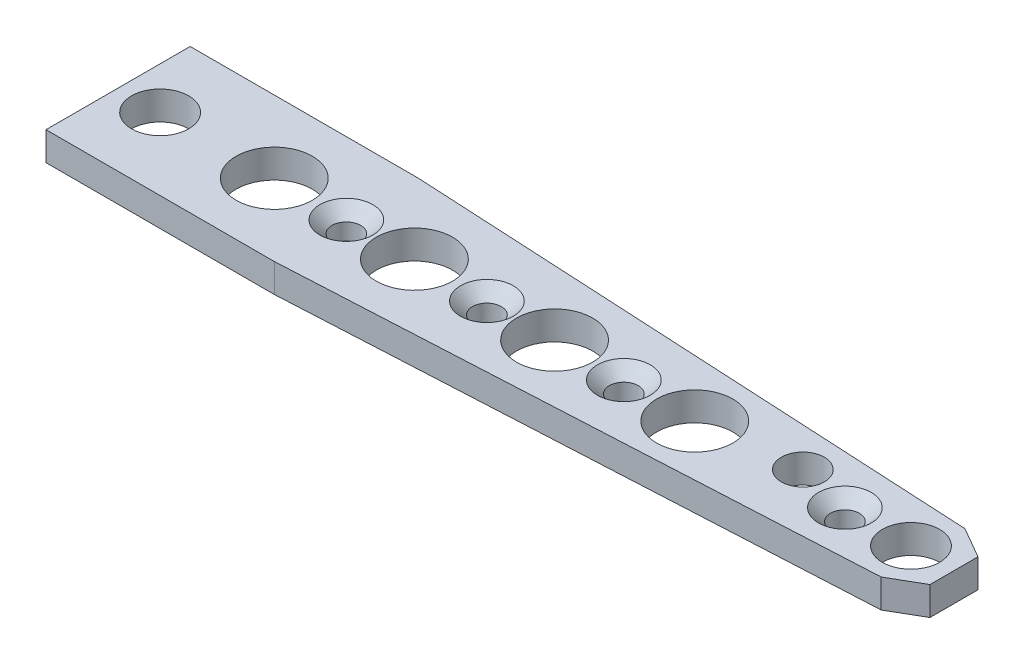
ISO-10303-21;
HEADER;
FILE_DESCRIPTION(('STEP AP214'),'2;1');
FILE_NAME('part.step','',(''),(''),'','','');
FILE_SCHEMA(('AUTOMOTIVE_DESIGN { 1 0 10303 214 1 1 1 1 }'));
ENDSEC;
DATA;
#1=APPLICATION_CONTEXT('core data for automotive mechanical design processes');
#2=APPLICATION_PROTOCOL_DEFINITION('international standard','automotive_design',2000,#1);
#3=PRODUCT_CONTEXT('',#1,'mechanical');
#4=PRODUCT('Part','Part','',(#3));
#5=PRODUCT_RELATED_PRODUCT_CATEGORY('part','',(#4));
#6=PRODUCT_DEFINITION_FORMATION('','',#4);
#7=PRODUCT_DEFINITION_CONTEXT('part definition',#1,'design');
#8=PRODUCT_DEFINITION('design','',#6,#7);
#9=PRODUCT_DEFINITION_SHAPE('','',#8);
#10=(LENGTH_UNIT() NAMED_UNIT(*) SI_UNIT(.MILLI.,.METRE.));
#11=(NAMED_UNIT(*) PLANE_ANGLE_UNIT() SI_UNIT($,.RADIAN.));
#12=(NAMED_UNIT(*) SI_UNIT($,.STERADIAN.) SOLID_ANGLE_UNIT());
#13=UNCERTAINTY_MEASURE_WITH_UNIT(LENGTH_MEASURE(1.E-05),#10,'distance_accuracy_value','');
#14=(GEOMETRIC_REPRESENTATION_CONTEXT(3) GLOBAL_UNCERTAINTY_ASSIGNED_CONTEXT((#13)) GLOBAL_UNIT_ASSIGNED_CONTEXT((#10,
#11,#12)) REPRESENTATION_CONTEXT('',''));
#15=CARTESIAN_POINT('',(0.,0.,0.));
#16=DIRECTION('',(0.,0.,1.));
#17=DIRECTION('',(1.,0.,0.));
#18=AXIS2_PLACEMENT_3D('',#15,#16,#17);
#19=CARTESIAN_POINT('',(69.58,2.38,-3.35));
#20=DIRECTION('',(-1.,0.,0.));
#21=DIRECTION('',(0.,0.,1.));
#22=AXIS2_PLACEMENT_3D('',#19,#20,#21);
#23=PLANE('',#22);
#24=DIRECTION('',(0.,0.,-1.));
#25=VECTOR('',#24,1.);
#26=CARTESIAN_POINT('',(69.58,2.38,-3.35));
#27=LINE('',#26,#25);
#28=CARTESIAN_POINT('',(69.58,2.38,2.00000000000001));
#29=VERTEX_POINT('',#28);
#30=CARTESIAN_POINT('',(69.58,2.38,-2.00000000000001));
#31=VERTEX_POINT('',#30);
#32=EDGE_CURVE('E116',#29,#31,#27,.T.);
#33=ORIENTED_EDGE('',*,*,#32,.F.);
#34=DIRECTION('',(0.,-1.,0.));
#35=VECTOR('',#34,1.);
#36=CARTESIAN_POINT('',(69.58,2.38,2.00000000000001));
#37=LINE('',#36,#35);
#38=CARTESIAN_POINT('',(69.58,0.,2.00000000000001));
#39=VERTEX_POINT('',#38);
#40=EDGE_CURVE('E192',#29,#39,#37,.T.);
#41=ORIENTED_EDGE('',*,*,#40,.T.);
#42=DIRECTION('',(0.,0.,-1.));
#43=VECTOR('',#42,1.);
#44=CARTESIAN_POINT('',(69.58,0.,-3.35));
#45=LINE('',#44,#43);
#46=CARTESIAN_POINT('',(69.58,0.,-2.00000000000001));
#47=VERTEX_POINT('',#46);
#48=EDGE_CURVE('E148',#39,#47,#45,.T.);
#49=ORIENTED_EDGE('',*,*,#48,.T.);
#50=DIRECTION('',(0.,1.,0.));
#51=VECTOR('',#50,1.);
#52=CARTESIAN_POINT('',(69.58,2.38,-2.00000000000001));
#53=LINE('',#52,#51);
#54=EDGE_CURVE('E189',#47,#31,#53,.T.);
#55=ORIENTED_EDGE('',*,*,#54,.T.);
#56=EDGE_LOOP('',(#33,#41,#49,#55));
#57=FACE_BOUND('',#56,.T.);
#58=ADVANCED_FACE('F40',(#57),#23,.F.);
#59=CARTESIAN_POINT('',(69.58,2.38,-3.35));
#60=DIRECTION('',(-0.0523359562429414,0.,0.998629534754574));
#61=DIRECTION('',(0.998629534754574,0.,0.0523359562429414));
#62=AXIS2_PLACEMENT_3D('',#59,#60,#61);
#63=PLANE('',#62);
#64=DIRECTION('',(-0.998629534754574,0.,-0.0523359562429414));
#65=VECTOR('',#64,1.);
#66=CARTESIAN_POINT('',(69.58,2.38,-3.35));
#67=LINE('',#66,#65);
#68=CARTESIAN_POINT('',(67.0082897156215,2.38,-3.48477762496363));
#69=VERTEX_POINT('',#68);
#70=CARTESIAN_POINT('',(19.0149877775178,2.38,-6.));
#71=VERTEX_POINT('',#70);
#72=EDGE_CURVE('E106',#69,#71,#67,.T.);
#73=ORIENTED_EDGE('',*,*,#72,.F.);
#74=DIRECTION('',(0.,-1.,0.));
#75=VECTOR('',#74,1.);
#76=CARTESIAN_POINT('',(67.0082897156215,2.38,-3.48477762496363));
#77=LINE('',#76,#75);
#78=CARTESIAN_POINT('',(67.0082897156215,0.,-3.48477762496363));
#79=VERTEX_POINT('',#78);
#80=EDGE_CURVE('E11',#69,#79,#77,.T.);
#81=ORIENTED_EDGE('',*,*,#80,.T.);
#82=DIRECTION('',(-0.998629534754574,0.,-0.0523359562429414));
#83=VECTOR('',#82,1.);
#84=CARTESIAN_POINT('',(69.58,0.,-3.35));
#85=LINE('',#84,#83);
#86=CARTESIAN_POINT('',(19.0149877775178,0.,-6.));
#87=VERTEX_POINT('',#86);
#88=EDGE_CURVE('E122',#79,#87,#85,.T.);
#89=ORIENTED_EDGE('',*,*,#88,.T.);
#90=DIRECTION('',(0.,-1.,0.));
#91=VECTOR('',#90,1.);
#92=CARTESIAN_POINT('',(19.0149877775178,2.38,-6.));
#93=LINE('',#92,#91);
#94=EDGE_CURVE('E119',#71,#87,#93,.T.);
#95=ORIENTED_EDGE('',*,*,#94,.F.);
#96=EDGE_LOOP('',(#73,#81,#89,#95));
#97=FACE_BOUND('',#96,.T.);
#98=ADVANCED_FACE('F120',(#97),#63,.F.);
#99=CARTESIAN_POINT('',(0.,2.38,-6.));
#100=DIRECTION('',(0.,0.,1.));
#101=DIRECTION('',(1.,0.,0.));
#102=AXIS2_PLACEMENT_3D('',#99,#100,#101);
#103=PLANE('',#102);
#104=DIRECTION('',(-1.,0.,0.));
#105=VECTOR('',#104,1.);
#106=CARTESIAN_POINT('',(0.,0.,-6.));
#107=LINE('',#106,#105);
#108=CARTESIAN_POINT('',(0.,0.,-6.));
#109=VERTEX_POINT('',#108);
#110=EDGE_CURVE('E155',#87,#109,#107,.T.);
#111=ORIENTED_EDGE('',*,*,#110,.T.);
#112=DIRECTION('',(0.,-1.,0.));
#113=VECTOR('',#112,1.);
#114=CARTESIAN_POINT('',(0.,2.38,-6.));
#115=LINE('',#114,#113);
#116=CARTESIAN_POINT('',(0.,2.38,-6.));
#117=VERTEX_POINT('',#116);
#118=EDGE_CURVE('E127',#117,#109,#115,.T.);
#119=ORIENTED_EDGE('',*,*,#118,.F.);
#120=DIRECTION('',(-1.,0.,0.));
#121=VECTOR('',#120,1.);
#122=CARTESIAN_POINT('',(0.,2.38,-6.));
#123=LINE('',#122,#121);
#124=EDGE_CURVE('E111',#71,#117,#123,.T.);
#125=ORIENTED_EDGE('',*,*,#124,.F.);
#126=ORIENTED_EDGE('',*,*,#94,.T.);
#127=EDGE_LOOP('',(#111,#119,#125,#126));
#128=FACE_BOUND('',#127,.T.);
#129=ADVANCED_FACE('F129',(#128),#103,.F.);
#130=CARTESIAN_POINT('',(0.,2.38,-6.));
#131=DIRECTION('',(1.,0.,0.));
#132=DIRECTION('',(0.,0.,-1.));
#133=AXIS2_PLACEMENT_3D('',#130,#131,#132);
#134=PLANE('',#133);
#135=DIRECTION('',(0.,0.,1.));
#136=VECTOR('',#135,1.);
#137=CARTESIAN_POINT('',(0.,0.,-6.));
#138=LINE('',#137,#136);
#139=CARTESIAN_POINT('',(0.,0.,6.));
#140=VERTEX_POINT('',#139);
#141=EDGE_CURVE('E158',#109,#140,#138,.T.);
#142=ORIENTED_EDGE('',*,*,#141,.T.);
#143=DIRECTION('',(0.,-1.,0.));
#144=VECTOR('',#143,1.);
#145=CARTESIAN_POINT('',(0.,2.38,6.));
#146=LINE('',#145,#144);
#147=CARTESIAN_POINT('',(0.,2.38,6.));
#148=VERTEX_POINT('',#147);
#149=EDGE_CURVE('E169',#148,#140,#146,.T.);
#150=ORIENTED_EDGE('',*,*,#149,.F.);
#151=DIRECTION('',(0.,0.,1.));
#152=VECTOR('',#151,1.);
#153=CARTESIAN_POINT('',(0.,2.38,-6.));
#154=LINE('',#153,#152);
#155=EDGE_CURVE('E133',#117,#148,#154,.T.);
#156=ORIENTED_EDGE('',*,*,#155,.F.);
#157=ORIENTED_EDGE('',*,*,#118,.T.);
#158=EDGE_LOOP('',(#142,#150,#156,#157));
#159=FACE_BOUND('',#158,.T.);
#160=ADVANCED_FACE('F229',(#159),#134,.F.);
#161=CARTESIAN_POINT('',(0.,2.38,6.));
#162=DIRECTION('',(0.,0.,-1.));
#163=DIRECTION('',(-1.,0.,0.));
#164=AXIS2_PLACEMENT_3D('',#161,#162,#163);
#165=PLANE('',#164);
#166=DIRECTION('',(1.,0.,0.));
#167=VECTOR('',#166,1.);
#168=CARTESIAN_POINT('',(0.,0.,6.));
#169=LINE('',#168,#167);
#170=CARTESIAN_POINT('',(19.0149877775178,0.,5.99999999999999));
#171=VERTEX_POINT('',#170);
#172=EDGE_CURVE('E160',#140,#171,#169,.T.);
#173=ORIENTED_EDGE('',*,*,#172,.T.);
#174=DIRECTION('',(0.,-1.,0.));
#175=VECTOR('',#174,1.);
#176=CARTESIAN_POINT('',(19.0149877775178,2.38,5.99999999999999));
#177=LINE('',#176,#175);
#178=CARTESIAN_POINT('',(19.0149877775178,2.38,5.99999999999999));
#179=VERTEX_POINT('',#178);
#180=EDGE_CURVE('E147',#179,#171,#177,.T.);
#181=ORIENTED_EDGE('',*,*,#180,.F.);
#182=DIRECTION('',(1.,0.,0.));
#183=VECTOR('',#182,1.);
#184=CARTESIAN_POINT('',(0.,2.38,6.));
#185=LINE('',#184,#183);
#186=EDGE_CURVE('E138',#148,#179,#185,.T.);
#187=ORIENTED_EDGE('',*,*,#186,.F.);
#188=ORIENTED_EDGE('',*,*,#149,.T.);
#189=EDGE_LOOP('',(#173,#181,#187,#188));
#190=FACE_BOUND('',#189,.T.);
#191=ADVANCED_FACE('F225',(#190),#165,.F.);
#192=CARTESIAN_POINT('',(19.0149877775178,2.38,5.99999999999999));
#193=DIRECTION('',(-0.0523359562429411,0.,-0.998629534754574));
#194=DIRECTION('',(-0.998629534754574,0.,0.0523359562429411));
#195=AXIS2_PLACEMENT_3D('',#192,#193,#194);
#196=PLANE('',#195);
#197=DIRECTION('',(0.998629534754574,0.,-0.0523359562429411));
#198=VECTOR('',#197,1.);
#199=CARTESIAN_POINT('',(19.0149877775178,0.,5.99999999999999));
#200=LINE('',#199,#198);
#201=CARTESIAN_POINT('',(67.0082897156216,0.,3.48477762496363));
#202=VERTEX_POINT('',#201);
#203=EDGE_CURVE('E163',#171,#202,#200,.T.);
#204=ORIENTED_EDGE('',*,*,#203,.T.);
#205=DIRECTION('',(0.,1.,0.));
#206=VECTOR('',#205,1.);
#207=CARTESIAN_POINT('',(67.0082897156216,2.38,3.48477762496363));
#208=LINE('',#207,#206);
#209=CARTESIAN_POINT('',(67.0082897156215,2.38,3.48477762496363));
#210=VERTEX_POINT('',#209);
#211=EDGE_CURVE('E64',#202,#210,#208,.T.);
#212=ORIENTED_EDGE('',*,*,#211,.T.);
#213=DIRECTION('',(0.998629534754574,0.,-0.0523359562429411));
#214=VECTOR('',#213,1.);
#215=CARTESIAN_POINT('',(19.0149877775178,2.38,5.99999999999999));
#216=LINE('',#215,#214);
#217=EDGE_CURVE('E144',#179,#210,#216,.T.);
#218=ORIENTED_EDGE('',*,*,#217,.F.);
#219=ORIENTED_EDGE('',*,*,#180,.T.);
#220=EDGE_LOOP('',(#204,#212,#218,#219));
#221=FACE_BOUND('',#220,.T.);
#222=ADVANCED_FACE('F221',(#221),#196,.F.);
#223=CARTESIAN_POINT('',(0.,2.38,0.));
#224=DIRECTION('',(0.,1.,0.));
#225=DIRECTION('',(0.,0.,1.));
#226=AXIS2_PLACEMENT_3D('',#223,#224,#225);
#227=PLANE('',#226);
#228=CARTESIAN_POINT('',(3.5,2.38,0.));
#229=DIRECTION('',(0.,1.,0.));
#230=DIRECTION('',(0.,0.,1.));
#231=AXIS2_PLACEMENT_3D('',#228,#229,#230);
#232=CIRCLE('',#231,2.38124999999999);
#233=CARTESIAN_POINT('',(3.5,2.38,2.38124999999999));
#234=VERTEX_POINT('',#233);
#235=EDGE_CURVE('E513',#234,#234,#232,.T.);
#236=ORIENTED_EDGE('',*,*,#235,.F.);
#237=EDGE_LOOP('',(#236));
#238=FACE_BOUND('',#237,.T.);
#239=CARTESIAN_POINT('',(66.,2.38,0.));
#240=DIRECTION('',(0.,1.,0.));
#241=DIRECTION('',(0.,0.,1.));
#242=AXIS2_PLACEMENT_3D('',#239,#240,#241);
#243=CIRCLE('',#242,2.38124999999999);
#244=CARTESIAN_POINT('',(66.,2.38,2.38124999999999));
#245=VERTEX_POINT('',#244);
#246=EDGE_CURVE('E518',#245,#245,#243,.T.);
#247=ORIENTED_EDGE('',*,*,#246,.F.);
#248=EDGE_LOOP('',(#247));
#249=FACE_BOUND('',#248,.T.);
#250=CARTESIAN_POINT('',(19.,2.38,0.));
#251=DIRECTION('',(0.,1.,0.));
#252=DIRECTION('',(0.,0.,1.));
#253=AXIS2_PLACEMENT_3D('',#250,#251,#252);
#254=CIRCLE('',#253,2.2);
#255=CARTESIAN_POINT('',(19.,2.38,2.2));
#256=VERTEX_POINT('',#255);
#257=EDGE_CURVE('E527',#256,#256,#254,.T.);
#258=ORIENTED_EDGE('',*,*,#257,.F.);
#259=EDGE_LOOP('',(#258));
#260=FACE_BOUND('',#259,.T.);
#261=CARTESIAN_POINT('',(30.7,2.38,0.));
#262=DIRECTION('',(0.,1.,0.));
#263=DIRECTION('',(0.,0.,1.));
#264=AXIS2_PLACEMENT_3D('',#261,#262,#263);
#265=CIRCLE('',#264,2.2);
#266=CARTESIAN_POINT('',(30.7,2.38,2.2));
#267=VERTEX_POINT('',#266);
#268=EDGE_CURVE('E539',#267,#267,#265,.T.);
#269=ORIENTED_EDGE('',*,*,#268,.F.);
#270=EDGE_LOOP('',(#269));
#271=FACE_BOUND('',#270,.T.);
#272=CARTESIAN_POINT('',(42.1,2.38,0.));
#273=DIRECTION('',(0.,1.,0.));
#274=DIRECTION('',(0.,0.,1.));
#275=AXIS2_PLACEMENT_3D('',#272,#273,#274);
#276=CIRCLE('',#275,2.2);
#277=CARTESIAN_POINT('',(42.1,2.38,2.2));
#278=VERTEX_POINT('',#277);
#279=EDGE_CURVE('E551',#278,#278,#276,.T.);
#280=ORIENTED_EDGE('',*,*,#279,.F.);
#281=EDGE_LOOP('',(#280));
#282=FACE_BOUND('',#281,.T.);
#283=CARTESIAN_POINT('',(60.5,2.38,0.));
#284=DIRECTION('',(0.,1.,0.));
#285=DIRECTION('',(0.,0.,1.));
#286=AXIS2_PLACEMENT_3D('',#283,#284,#285);
#287=CIRCLE('',#286,2.19999999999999);
#288=CARTESIAN_POINT('',(60.5,2.38,2.19999999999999));
#289=VERTEX_POINT('',#288);
#290=EDGE_CURVE('E563',#289,#289,#287,.T.);
#291=ORIENTED_EDGE('',*,*,#290,.F.);
#292=EDGE_LOOP('',(#291));
#293=FACE_BOUND('',#292,.T.);
#294=CARTESIAN_POINT('',(56.,2.38,-1.));
#295=DIRECTION('',(0.,1.,0.));
#296=DIRECTION('',(0.,0.,1.));
#297=AXIS2_PLACEMENT_3D('',#294,#295,#296);
#298=CIRCLE('',#297,1.78600099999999);
#299=CARTESIAN_POINT('',(56.,2.38,0.786000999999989));
#300=VERTEX_POINT('',#299);
#301=EDGE_CURVE('E575',#300,#300,#298,.T.);
#302=ORIENTED_EDGE('',*,*,#301,.F.);
#303=EDGE_LOOP('',(#302));
#304=FACE_BOUND('',#303,.T.);
#305=CARTESIAN_POINT('',(24.667,2.38,0.));
#306=DIRECTION('',(0.,1.,0.));
#307=DIRECTION('',(0.,0.,1.));
#308=AXIS2_PLACEMENT_3D('',#305,#306,#307);
#309=CIRCLE('',#308,3.175);
#310=CARTESIAN_POINT('',(24.667,2.38,3.175));
#311=VERTEX_POINT('',#310);
#312=EDGE_CURVE('E587',#311,#311,#309,.T.);
#313=ORIENTED_EDGE('',*,*,#312,.F.);
#314=EDGE_LOOP('',(#313));
#315=FACE_BOUND('',#314,.T.);
#316=CARTESIAN_POINT('',(13.,2.38,0.));
#317=DIRECTION('',(0.,1.,0.));
#318=DIRECTION('',(0.,0.,1.));
#319=AXIS2_PLACEMENT_3D('',#316,#317,#318);
#320=CIRCLE('',#319,3.175);
#321=CARTESIAN_POINT('',(13.,2.38,3.175));
#322=VERTEX_POINT('',#321);
#323=EDGE_CURVE('E591',#322,#322,#320,.T.);
#324=ORIENTED_EDGE('',*,*,#323,.F.);
#325=EDGE_LOOP('',(#324));
#326=FACE_BOUND('',#325,.T.);
#327=ORIENTED_EDGE('',*,*,#217,.T.);
#328=DIRECTION('',(-0.86602540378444,0.,0.499999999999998));
#329=VECTOR('',#328,1.);
#330=CARTESIAN_POINT('',(18.2610254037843,2.38,31.6290237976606));
#331=LINE('',#330,#329);
#332=EDGE_CURVE('E49',#210,#29,#331,.F.);
#333=ORIENTED_EDGE('',*,*,#332,.T.);
#334=ORIENTED_EDGE('',*,*,#32,.T.);
#335=DIRECTION('',(0.86602540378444,0.,0.499999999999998));
#336=VECTOR('',#335,1.);
#337=CARTESIAN_POINT('',(18.2610254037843,2.38,-31.6290237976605));
#338=LINE('',#337,#336);
#339=EDGE_CURVE('E56',#31,#69,#338,.F.);
#340=ORIENTED_EDGE('',*,*,#339,.T.);
#341=ORIENTED_EDGE('',*,*,#72,.T.);
#342=ORIENTED_EDGE('',*,*,#124,.T.);
#343=ORIENTED_EDGE('',*,*,#155,.T.);
#344=ORIENTED_EDGE('',*,*,#186,.T.);
#345=EDGE_LOOP('',(#327,#333,#334,#340,#341,#342,#343,#344));
#346=FACE_BOUND('',#345,.T.);
#347=CARTESIAN_POINT('',(36.334,2.38,0.));
#348=DIRECTION('',(0.,1.,0.));
#349=DIRECTION('',(0.,0.,1.));
#350=AXIS2_PLACEMENT_3D('',#347,#348,#349);
#351=CIRCLE('',#350,3.175);
#352=CARTESIAN_POINT('',(36.334,2.38,3.175));
#353=VERTEX_POINT('',#352);
#354=EDGE_CURVE('E177',#353,#353,#351,.T.);
#355=ORIENTED_EDGE('',*,*,#354,.F.);
#356=EDGE_LOOP('',(#355));
#357=FACE_BOUND('',#356,.T.);
#358=CARTESIAN_POINT('',(48.001,2.38,0.));
#359=DIRECTION('',(0.,1.,0.));
#360=DIRECTION('',(0.,0.,1.));
#361=AXIS2_PLACEMENT_3D('',#358,#359,#360);
#362=CIRCLE('',#361,3.175);
#363=CARTESIAN_POINT('',(48.001,2.38,3.175));
#364=VERTEX_POINT('',#363);
#365=EDGE_CURVE('E185',#364,#364,#362,.T.);
#366=ORIENTED_EDGE('',*,*,#365,.F.);
#367=EDGE_LOOP('',(#366));
#368=FACE_BOUND('',#367,.T.);
#369=ADVANCED_FACE('F108',(#238,#249,#260,#271,#282,#293,#304,#315,#326,#346,#357,#368),#227,.T.);
#370=CARTESIAN_POINT('',(0.,0.,0.));
#371=DIRECTION('',(0.,1.,0.));
#372=DIRECTION('',(0.,0.,1.));
#373=AXIS2_PLACEMENT_3D('',#370,#371,#372);
#374=PLANE('',#373);
#375=CARTESIAN_POINT('',(3.5,0.,0.));
#376=DIRECTION('',(0.,1.,0.));
#377=DIRECTION('',(0.,0.,1.));
#378=AXIS2_PLACEMENT_3D('',#375,#376,#377);
#379=CIRCLE('',#378,2.38125);
#380=CARTESIAN_POINT('',(3.5,0.,2.38125));
#381=VERTEX_POINT('',#380);
#382=EDGE_CURVE('E510',#381,#381,#379,.T.);
#383=ORIENTED_EDGE('',*,*,#382,.T.);
#384=EDGE_LOOP('',(#383));
#385=FACE_BOUND('',#384,.T.);
#386=CARTESIAN_POINT('',(66.,0.,0.));
#387=DIRECTION('',(0.,1.,0.));
#388=DIRECTION('',(0.,0.,1.));
#389=AXIS2_PLACEMENT_3D('',#386,#387,#388);
#390=CIRCLE('',#389,2.38125);
#391=CARTESIAN_POINT('',(66.,0.,2.38125));
#392=VERTEX_POINT('',#391);
#393=EDGE_CURVE('E523',#392,#392,#390,.T.);
#394=ORIENTED_EDGE('',*,*,#393,.T.);
#395=EDGE_LOOP('',(#394));
#396=FACE_BOUND('',#395,.T.);
#397=CARTESIAN_POINT('',(19.,0.,0.));
#398=DIRECTION('',(0.,1.,0.));
#399=DIRECTION('',(0.,0.,1.));
#400=AXIS2_PLACEMENT_3D('',#397,#398,#399);
#401=CIRCLE('',#400,1.2);
#402=CARTESIAN_POINT('',(19.,0.,1.2));
#403=VERTEX_POINT('',#402);
#404=EDGE_CURVE('E535',#403,#403,#401,.T.);
#405=ORIENTED_EDGE('',*,*,#404,.T.);
#406=EDGE_LOOP('',(#405));
#407=FACE_BOUND('',#406,.T.);
#408=CARTESIAN_POINT('',(30.7,0.,0.));
#409=DIRECTION('',(0.,1.,0.));
#410=DIRECTION('',(0.,0.,1.));
#411=AXIS2_PLACEMENT_3D('',#408,#409,#410);
#412=CIRCLE('',#411,1.2);
#413=CARTESIAN_POINT('',(30.7,0.,1.2));
#414=VERTEX_POINT('',#413);
#415=EDGE_CURVE('E547',#414,#414,#412,.T.);
#416=ORIENTED_EDGE('',*,*,#415,.T.);
#417=EDGE_LOOP('',(#416));
#418=FACE_BOUND('',#417,.T.);
#419=CARTESIAN_POINT('',(42.1,0.,0.));
#420=DIRECTION('',(0.,1.,0.));
#421=DIRECTION('',(0.,0.,1.));
#422=AXIS2_PLACEMENT_3D('',#419,#420,#421);
#423=CIRCLE('',#422,1.2);
#424=CARTESIAN_POINT('',(42.1,0.,1.2));
#425=VERTEX_POINT('',#424);
#426=EDGE_CURVE('E559',#425,#425,#423,.T.);
#427=ORIENTED_EDGE('',*,*,#426,.T.);
#428=EDGE_LOOP('',(#427));
#429=FACE_BOUND('',#428,.T.);
#430=CARTESIAN_POINT('',(60.5,0.,0.));
#431=DIRECTION('',(0.,1.,0.));
#432=DIRECTION('',(0.,0.,1.));
#433=AXIS2_PLACEMENT_3D('',#430,#431,#432);
#434=CIRCLE('',#433,1.2);
#435=CARTESIAN_POINT('',(60.5,0.,1.2));
#436=VERTEX_POINT('',#435);
#437=EDGE_CURVE('E571',#436,#436,#434,.T.);
#438=ORIENTED_EDGE('',*,*,#437,.T.);
#439=EDGE_LOOP('',(#438));
#440=FACE_BOUND('',#439,.T.);
#441=CARTESIAN_POINT('',(56.,0.,-1.));
#442=DIRECTION('',(0.,1.,0.));
#443=DIRECTION('',(0.,0.,1.));
#444=AXIS2_PLACEMENT_3D('',#441,#442,#443);
#445=CIRCLE('',#444,1.786001);
#446=CARTESIAN_POINT('',(56.,0.,0.786001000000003));
#447=VERTEX_POINT('',#446);
#448=EDGE_CURVE('E579',#447,#447,#445,.T.);
#449=ORIENTED_EDGE('',*,*,#448,.T.);
#450=EDGE_LOOP('',(#449));
#451=FACE_BOUND('',#450,.T.);
#452=CARTESIAN_POINT('',(24.667,0.,0.));
#453=DIRECTION('',(0.,1.,0.));
#454=DIRECTION('',(0.,0.,1.));
#455=AXIS2_PLACEMENT_3D('',#452,#453,#454);
#456=CIRCLE('',#455,3.175);
#457=CARTESIAN_POINT('',(24.667,0.,3.175));
#458=VERTEX_POINT('',#457);
#459=EDGE_CURVE('E583',#458,#458,#456,.T.);
#460=ORIENTED_EDGE('',*,*,#459,.T.);
#461=EDGE_LOOP('',(#460));
#462=FACE_BOUND('',#461,.T.);
#463=CARTESIAN_POINT('',(13.,0.,0.));
#464=DIRECTION('',(0.,1.,0.));
#465=DIRECTION('',(0.,0.,1.));
#466=AXIS2_PLACEMENT_3D('',#463,#464,#465);
#467=CIRCLE('',#466,3.175);
#468=CARTESIAN_POINT('',(13.,0.,3.175));
#469=VERTEX_POINT('',#468);
#470=EDGE_CURVE('E152',#469,#469,#467,.T.);
#471=ORIENTED_EDGE('',*,*,#470,.T.);
#472=EDGE_LOOP('',(#471));
#473=FACE_BOUND('',#472,.T.);
#474=ORIENTED_EDGE('',*,*,#48,.F.);
#475=DIRECTION('',(0.86602540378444,0.,-0.499999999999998));
#476=VECTOR('',#475,1.);
#477=CARTESIAN_POINT('',(69.58,0.,2.00000000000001));
#478=LINE('',#477,#476);
#479=EDGE_CURVE('E199',#39,#202,#478,.F.);
#480=ORIENTED_EDGE('',*,*,#479,.T.);
#481=ORIENTED_EDGE('',*,*,#203,.F.);
#482=ORIENTED_EDGE('',*,*,#172,.F.);
#483=ORIENTED_EDGE('',*,*,#141,.F.);
#484=ORIENTED_EDGE('',*,*,#110,.F.);
#485=ORIENTED_EDGE('',*,*,#88,.F.);
#486=DIRECTION('',(-0.86602540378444,0.,-0.499999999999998));
#487=VECTOR('',#486,1.);
#488=CARTESIAN_POINT('',(67.0082897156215,0.,-3.48477762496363));
#489=LINE('',#488,#487);
#490=EDGE_CURVE('E196',#79,#47,#489,.F.);
#491=ORIENTED_EDGE('',*,*,#490,.T.);
#492=EDGE_LOOP('',(#474,#480,#481,#482,#483,#484,#485,#491));
#493=FACE_BOUND('',#492,.T.);
#494=CARTESIAN_POINT('',(36.334,0.,0.));
#495=DIRECTION('',(0.,1.,0.));
#496=DIRECTION('',(0.,0.,1.));
#497=AXIS2_PLACEMENT_3D('',#494,#495,#496);
#498=CIRCLE('',#497,3.175);
#499=CARTESIAN_POINT('',(36.334,0.,3.175));
#500=VERTEX_POINT('',#499);
#501=EDGE_CURVE('E126',#500,#500,#498,.T.);
#502=ORIENTED_EDGE('',*,*,#501,.T.);
#503=EDGE_LOOP('',(#502));
#504=FACE_BOUND('',#503,.T.);
#505=CARTESIAN_POINT('',(48.001,0.,0.));
#506=DIRECTION('',(0.,1.,0.));
#507=DIRECTION('',(0.,0.,1.));
#508=AXIS2_PLACEMENT_3D('',#505,#506,#507);
#509=CIRCLE('',#508,3.175);
#510=CARTESIAN_POINT('',(48.001,0.,3.175));
#511=VERTEX_POINT('',#510);
#512=EDGE_CURVE('E181',#511,#511,#509,.T.);
#513=ORIENTED_EDGE('',*,*,#512,.T.);
#514=EDGE_LOOP('',(#513));
#515=FACE_BOUND('',#514,.T.);
#516=ADVANCED_FACE('F218',(#385,#396,#407,#418,#429,#440,#451,#462,#473,#493,#504,#515),#374,.F.);
#517=CARTESIAN_POINT('',(13.,2.38,0.));
#518=DIRECTION('',(0.,1.,0.));
#519=DIRECTION('',(0.,0.,1.));
#520=AXIS2_PLACEMENT_3D('',#517,#518,#519);
#521=CYLINDRICAL_SURFACE('',#520,3.175);
#522=ORIENTED_EDGE('',*,*,#470,.F.);
#523=EDGE_LOOP('',(#522));
#524=FACE_BOUND('',#523,.T.);
#525=ORIENTED_EDGE('',*,*,#323,.T.);
#526=EDGE_LOOP('',(#525));
#527=FACE_BOUND('',#526,.T.);
#528=ADVANCED_FACE('F304',(#524,#527),#521,.F.);
#529=CARTESIAN_POINT('',(24.667,2.38,0.));
#530=DIRECTION('',(0.,1.,0.));
#531=DIRECTION('',(0.,0.,1.));
#532=AXIS2_PLACEMENT_3D('',#529,#530,#531);
#533=CYLINDRICAL_SURFACE('',#532,3.175);
#534=ORIENTED_EDGE('',*,*,#459,.F.);
#535=EDGE_LOOP('',(#534));
#536=FACE_BOUND('',#535,.T.);
#537=ORIENTED_EDGE('',*,*,#312,.T.);
#538=EDGE_LOOP('',(#537));
#539=FACE_BOUND('',#538,.T.);
#540=ADVANCED_FACE('F249',(#536,#539),#533,.F.);
#541=CARTESIAN_POINT('',(36.334,2.38,0.));
#542=DIRECTION('',(0.,1.,0.));
#543=DIRECTION('',(0.,0.,1.));
#544=AXIS2_PLACEMENT_3D('',#541,#542,#543);
#545=CYLINDRICAL_SURFACE('',#544,3.175);
#546=ORIENTED_EDGE('',*,*,#501,.F.);
#547=EDGE_LOOP('',(#546));
#548=FACE_BOUND('',#547,.T.);
#549=ORIENTED_EDGE('',*,*,#354,.T.);
#550=EDGE_LOOP('',(#549));
#551=FACE_BOUND('',#550,.T.);
#552=ADVANCED_FACE('F245',(#548,#551),#545,.F.);
#553=CARTESIAN_POINT('',(48.001,2.38,0.));
#554=DIRECTION('',(0.,1.,0.));
#555=DIRECTION('',(0.,0.,1.));
#556=AXIS2_PLACEMENT_3D('',#553,#554,#555);
#557=CYLINDRICAL_SURFACE('',#556,3.175);
#558=ORIENTED_EDGE('',*,*,#512,.F.);
#559=EDGE_LOOP('',(#558));
#560=FACE_BOUND('',#559,.T.);
#561=ORIENTED_EDGE('',*,*,#365,.T.);
#562=EDGE_LOOP('',(#561));
#563=FACE_BOUND('',#562,.T.);
#564=ADVANCED_FACE('F248',(#560,#563),#557,.F.);
#565=CARTESIAN_POINT('',(56.,2.38,-1.));
#566=DIRECTION('',(0.,1.,0.));
#567=DIRECTION('',(0.,0.,1.));
#568=AXIS2_PLACEMENT_3D('',#565,#566,#567);
#569=CYLINDRICAL_SURFACE('',#568,1.786001);
#570=ORIENTED_EDGE('',*,*,#448,.F.);
#571=EDGE_LOOP('',(#570));
#572=FACE_BOUND('',#571,.T.);
#573=ORIENTED_EDGE('',*,*,#301,.T.);
#574=EDGE_LOOP('',(#573));
#575=FACE_BOUND('',#574,.T.);
#576=ADVANCED_FACE('F252',(#572,#575),#569,.F.);
#577=CARTESIAN_POINT('',(60.5,2.38,0.));
#578=DIRECTION('',(0.,1.,0.));
#579=DIRECTION('',(0.,0.,1.));
#580=AXIS2_PLACEMENT_3D('',#577,#578,#579);
#581=CYLINDRICAL_SURFACE('',#580,1.2);
#582=ORIENTED_EDGE('',*,*,#437,.F.);
#583=EDGE_LOOP('',(#582));
#584=FACE_BOUND('',#583,.T.);
#585=CARTESIAN_POINT('',(60.5,1.38,0.));
#586=DIRECTION('',(0.,1.,0.));
#587=DIRECTION('',(0.,0.,1.));
#588=AXIS2_PLACEMENT_3D('',#585,#586,#587);
#589=CIRCLE('',#588,1.2);
#590=CARTESIAN_POINT('',(60.5,1.38,1.2));
#591=VERTEX_POINT('',#590);
#592=EDGE_CURVE('E567',#591,#591,#589,.T.);
#593=ORIENTED_EDGE('',*,*,#592,.T.);
#594=EDGE_LOOP('',(#593));
#595=FACE_BOUND('',#594,.T.);
#596=ADVANCED_FACE('F294',(#584,#595),#581,.F.);
#597=CARTESIAN_POINT('',(60.5,2.38,0.));
#598=DIRECTION('',(0.,1.,0.));
#599=DIRECTION('',(0.,0.,1.));
#600=AXIS2_PLACEMENT_3D('',#597,#598,#599);
#601=CONICAL_SURFACE('',#600,2.19999999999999,0.785398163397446);
#602=ORIENTED_EDGE('',*,*,#592,.F.);
#603=EDGE_LOOP('',(#602));
#604=FACE_BOUND('',#603,.T.);
#605=ORIENTED_EDGE('',*,*,#290,.T.);
#606=EDGE_LOOP('',(#605));
#607=FACE_BOUND('',#606,.T.);
#608=ADVANCED_FACE('F290',(#604,#607),#601,.F.);
#609=CARTESIAN_POINT('',(42.1,2.38,0.));
#610=DIRECTION('',(0.,1.,0.));
#611=DIRECTION('',(0.,0.,1.));
#612=AXIS2_PLACEMENT_3D('',#609,#610,#611);
#613=CYLINDRICAL_SURFACE('',#612,1.2);
#614=ORIENTED_EDGE('',*,*,#426,.F.);
#615=EDGE_LOOP('',(#614));
#616=FACE_BOUND('',#615,.T.);
#617=CARTESIAN_POINT('',(42.1,1.38,0.));
#618=DIRECTION('',(0.,1.,0.));
#619=DIRECTION('',(0.,0.,1.));
#620=AXIS2_PLACEMENT_3D('',#617,#618,#619);
#621=CIRCLE('',#620,1.2);
#622=CARTESIAN_POINT('',(42.1,1.38,1.2));
#623=VERTEX_POINT('',#622);
#624=EDGE_CURVE('E555',#623,#623,#621,.T.);
#625=ORIENTED_EDGE('',*,*,#624,.T.);
#626=EDGE_LOOP('',(#625));
#627=FACE_BOUND('',#626,.T.);
#628=ADVANCED_FACE('F286',(#616,#627),#613,.F.);
#629=CARTESIAN_POINT('',(42.1,2.38,0.));
#630=DIRECTION('',(0.,1.,0.));
#631=DIRECTION('',(0.,0.,1.));
#632=AXIS2_PLACEMENT_3D('',#629,#630,#631);
#633=CONICAL_SURFACE('',#632,2.2,0.785398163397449);
#634=ORIENTED_EDGE('',*,*,#624,.F.);
#635=EDGE_LOOP('',(#634));
#636=FACE_BOUND('',#635,.T.);
#637=ORIENTED_EDGE('',*,*,#279,.T.);
#638=EDGE_LOOP('',(#637));
#639=FACE_BOUND('',#638,.T.);
#640=ADVANCED_FACE('F282',(#636,#639),#633,.F.);
#641=CARTESIAN_POINT('',(30.7,2.38,0.));
#642=DIRECTION('',(0.,1.,0.));
#643=DIRECTION('',(0.,0.,1.));
#644=AXIS2_PLACEMENT_3D('',#641,#642,#643);
#645=CYLINDRICAL_SURFACE('',#644,1.2);
#646=ORIENTED_EDGE('',*,*,#415,.F.);
#647=EDGE_LOOP('',(#646));
#648=FACE_BOUND('',#647,.T.);
#649=CARTESIAN_POINT('',(30.7,1.38,0.));
#650=DIRECTION('',(0.,1.,0.));
#651=DIRECTION('',(0.,0.,1.));
#652=AXIS2_PLACEMENT_3D('',#649,#650,#651);
#653=CIRCLE('',#652,1.2);
#654=CARTESIAN_POINT('',(30.7,1.38,1.2));
#655=VERTEX_POINT('',#654);
#656=EDGE_CURVE('E543',#655,#655,#653,.T.);
#657=ORIENTED_EDGE('',*,*,#656,.T.);
#658=EDGE_LOOP('',(#657));
#659=FACE_BOUND('',#658,.T.);
#660=ADVANCED_FACE('F278',(#648,#659),#645,.F.);
#661=CARTESIAN_POINT('',(30.7,2.38,0.));
#662=DIRECTION('',(0.,1.,0.));
#663=DIRECTION('',(0.,0.,1.));
#664=AXIS2_PLACEMENT_3D('',#661,#662,#663);
#665=CONICAL_SURFACE('',#664,2.2,0.785398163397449);
#666=ORIENTED_EDGE('',*,*,#656,.F.);
#667=EDGE_LOOP('',(#666));
#668=FACE_BOUND('',#667,.T.);
#669=ORIENTED_EDGE('',*,*,#268,.T.);
#670=EDGE_LOOP('',(#669));
#671=FACE_BOUND('',#670,.T.);
#672=ADVANCED_FACE('F268',(#668,#671),#665,.F.);
#673=CARTESIAN_POINT('',(19.,2.38,0.));
#674=DIRECTION('',(0.,1.,0.));
#675=DIRECTION('',(0.,0.,1.));
#676=AXIS2_PLACEMENT_3D('',#673,#674,#675);
#677=CYLINDRICAL_SURFACE('',#676,1.2);
#678=ORIENTED_EDGE('',*,*,#404,.F.);
#679=EDGE_LOOP('',(#678));
#680=FACE_BOUND('',#679,.T.);
#681=CARTESIAN_POINT('',(19.,1.38,0.));
#682=DIRECTION('',(0.,1.,0.));
#683=DIRECTION('',(0.,0.,1.));
#684=AXIS2_PLACEMENT_3D('',#681,#682,#683);
#685=CIRCLE('',#684,1.2);
#686=CARTESIAN_POINT('',(19.,1.38,1.2));
#687=VERTEX_POINT('',#686);
#688=EDGE_CURVE('E531',#687,#687,#685,.T.);
#689=ORIENTED_EDGE('',*,*,#688,.T.);
#690=EDGE_LOOP('',(#689));
#691=FACE_BOUND('',#690,.T.);
#692=ADVANCED_FACE('F262',(#680,#691),#677,.F.);
#693=CARTESIAN_POINT('',(19.,2.38,0.));
#694=DIRECTION('',(0.,1.,0.));
#695=DIRECTION('',(0.,0.,1.));
#696=AXIS2_PLACEMENT_3D('',#693,#694,#695);
#697=CONICAL_SURFACE('',#696,2.2,0.785398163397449);
#698=ORIENTED_EDGE('',*,*,#688,.F.);
#699=EDGE_LOOP('',(#698));
#700=FACE_BOUND('',#699,.T.);
#701=ORIENTED_EDGE('',*,*,#257,.T.);
#702=EDGE_LOOP('',(#701));
#703=FACE_BOUND('',#702,.T.);
#704=ADVANCED_FACE('F255',(#700,#703),#697,.F.);
#705=CARTESIAN_POINT('',(69.58,2.38,2.00000000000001));
#706=DIRECTION('',(-0.499999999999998,0.,-0.86602540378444));
#707=DIRECTION('',(0.,-1.,0.));
#708=AXIS2_PLACEMENT_3D('',#705,#706,#707);
#709=PLANE('',#708);
#710=ORIENTED_EDGE('',*,*,#332,.F.);
#711=ORIENTED_EDGE('',*,*,#211,.F.);
#712=ORIENTED_EDGE('',*,*,#479,.F.);
#713=ORIENTED_EDGE('',*,*,#40,.F.);
#714=EDGE_LOOP('',(#710,#711,#712,#713));
#715=FACE_BOUND('',#714,.T.);
#716=ADVANCED_FACE('F215',(#715),#709,.F.);
#717=CARTESIAN_POINT('',(67.0082897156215,2.38,-3.48477762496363));
#718=DIRECTION('',(-0.499999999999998,0.,0.86602540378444));
#719=DIRECTION('',(0.,-1.,0.));
#720=AXIS2_PLACEMENT_3D('',#717,#718,#719);
#721=PLANE('',#720);
#722=ORIENTED_EDGE('',*,*,#339,.F.);
#723=ORIENTED_EDGE('',*,*,#54,.F.);
#724=ORIENTED_EDGE('',*,*,#490,.F.);
#725=ORIENTED_EDGE('',*,*,#80,.F.);
#726=EDGE_LOOP('',(#722,#723,#724,#725));
#727=FACE_BOUND('',#726,.T.);
#728=ADVANCED_FACE('F42',(#727),#721,.F.);
#729=CARTESIAN_POINT('',(66.,2.38,0.));
#730=DIRECTION('',(0.,1.,0.));
#731=DIRECTION('',(0.,0.,1.));
#732=AXIS2_PLACEMENT_3D('',#729,#730,#731);
#733=CYLINDRICAL_SURFACE('',#732,2.38124999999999);
#734=ORIENTED_EDGE('',*,*,#393,.F.);
#735=EDGE_LOOP('',(#734));
#736=FACE_BOUND('',#735,.T.);
#737=ORIENTED_EDGE('',*,*,#246,.T.);
#738=EDGE_LOOP('',(#737));
#739=FACE_BOUND('',#738,.T.);
#740=ADVANCED_FACE('F260',(#736,#739),#733,.F.);
#741=CARTESIAN_POINT('',(3.5,2.38,0.));
#742=DIRECTION('',(0.,1.,0.));
#743=DIRECTION('',(0.,0.,1.));
#744=AXIS2_PLACEMENT_3D('',#741,#742,#743);
#745=CYLINDRICAL_SURFACE('',#744,2.38124999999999);
#746=ORIENTED_EDGE('',*,*,#382,.F.);
#747=EDGE_LOOP('',(#746));
#748=FACE_BOUND('',#747,.T.);
#749=ORIENTED_EDGE('',*,*,#235,.T.);
#750=EDGE_LOOP('',(#749));
#751=FACE_BOUND('',#750,.T.);
#752=ADVANCED_FACE('F381',(#748,#751),#745,.F.);
#753=CLOSED_SHELL('',(#58,#98,#129,#160,#191,#222,#369,#516,#528,#540,#552,#564,#576,#596,#608,
#628,#640,#660,#672,#692,#704,#716,#728,#740,#752));
#754=MANIFOLD_SOLID_BREP('B2',#753);
#755=ADVANCED_BREP_SHAPE_REPRESENTATION('',(#18,#754),#14);
#756=SHAPE_DEFINITION_REPRESENTATION(#9,#755);
ENDSEC;
END-ISO-10303-21;
